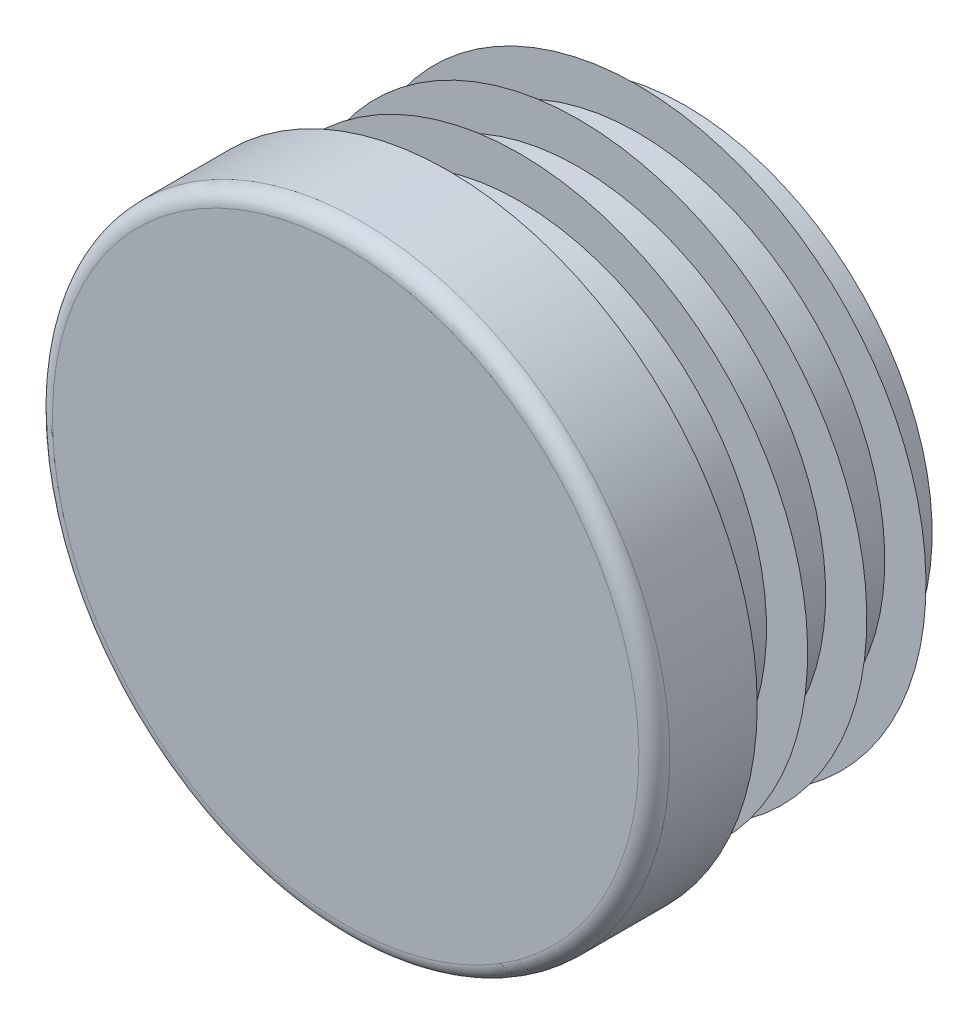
ISO-10303-21;
HEADER;
FILE_DESCRIPTION(('STEP AP214'),'2;1');
FILE_NAME('part.step','',(''),(''),'','','');
FILE_SCHEMA(('AUTOMOTIVE_DESIGN { 1 0 10303 214 1 1 1 1 }'));
ENDSEC;
DATA;
#1=APPLICATION_CONTEXT('core data for automotive mechanical design processes');
#2=APPLICATION_PROTOCOL_DEFINITION('international standard','automotive_design',2000,#1);
#3=PRODUCT_CONTEXT('',#1,'mechanical');
#4=PRODUCT('Part','Part','',(#3));
#5=PRODUCT_RELATED_PRODUCT_CATEGORY('part','',(#4));
#6=PRODUCT_DEFINITION_FORMATION('','',#4);
#7=PRODUCT_DEFINITION_CONTEXT('part definition',#1,'design');
#8=PRODUCT_DEFINITION('design','',#6,#7);
#9=PRODUCT_DEFINITION_SHAPE('','',#8);
#10=(LENGTH_UNIT() NAMED_UNIT(*) SI_UNIT(.MILLI.,.METRE.));
#11=(NAMED_UNIT(*) PLANE_ANGLE_UNIT() SI_UNIT($,.RADIAN.));
#12=(NAMED_UNIT(*) SI_UNIT($,.STERADIAN.) SOLID_ANGLE_UNIT());
#13=UNCERTAINTY_MEASURE_WITH_UNIT(LENGTH_MEASURE(1.E-05),#10,'distance_accuracy_value','');
#14=(GEOMETRIC_REPRESENTATION_CONTEXT(3) GLOBAL_UNCERTAINTY_ASSIGNED_CONTEXT((#13)) GLOBAL_UNIT_ASSIGNED_CONTEXT((#10,
#11,#12)) REPRESENTATION_CONTEXT('',''));
#15=CARTESIAN_POINT('',(0.,0.,0.));
#16=DIRECTION('',(0.,0.,1.));
#17=DIRECTION('',(1.,0.,0.));
#18=AXIS2_PLACEMENT_3D('',#15,#16,#17);
#19=CARTESIAN_POINT('',(0.,0.,5.));
#20=DIRECTION('',(0.,0.,-1.));
#21=DIRECTION('',(0.,1.,0.));
#22=AXIS2_PLACEMENT_3D('',#19,#20,#21);
#23=PLANE('',#22);
#24=CARTESIAN_POINT('',(0.,0.,5.));
#25=DIRECTION('',(0.,0.,-1.));
#26=DIRECTION('',(0.,1.,0.));
#27=AXIS2_PLACEMENT_3D('',#24,#25,#26);
#28=CIRCLE('',#27,14.25);
#29=CARTESIAN_POINT('',(0.,14.25,5.));
#30=VERTEX_POINT('',#29);
#31=EDGE_CURVE('E8',#30,#30,#28,.T.);
#32=ORIENTED_EDGE('',*,*,#31,.F.);
#33=EDGE_LOOP('',(#32));
#34=FACE_BOUND('',#33,.T.);
#35=ADVANCED_FACE('F12',(#34),#23,.F.);
#36=CARTESIAN_POINT('',(0.,0.,4.25));
#37=DIRECTION('',(0.,0.,-1.));
#38=DIRECTION('',(0.,1.,0.));
#39=AXIS2_PLACEMENT_3D('',#36,#37,#38);
#40=TOROIDAL_SURFACE('',#39,14.25,0.75);
#41=ORIENTED_EDGE('',*,*,#31,.T.);
#42=EDGE_LOOP('',(#41));
#43=FACE_BOUND('',#42,.T.);
#44=CARTESIAN_POINT('',(0.,0.,4.25));
#45=DIRECTION('',(0.,0.,-1.));
#46=DIRECTION('',(0.,1.,0.));
#47=AXIS2_PLACEMENT_3D('',#44,#45,#46);
#48=CIRCLE('',#47,15.);
#49=CARTESIAN_POINT('',(0.,15.,4.25));
#50=VERTEX_POINT('',#49);
#51=EDGE_CURVE('E18',#50,#50,#48,.T.);
#52=ORIENTED_EDGE('',*,*,#51,.F.);
#53=EDGE_LOOP('',(#52));
#54=FACE_BOUND('',#53,.T.);
#55=ADVANCED_FACE('F159',(#43,#54),#40,.T.);
#56=CARTESIAN_POINT('',(0.,0.,-11.5));
#57=DIRECTION('',(0.,0.,-1.));
#58=DIRECTION('',(0.,1.,0.));
#59=AXIS2_PLACEMENT_3D('',#56,#57,#58);
#60=CYLINDRICAL_SURFACE('',#59,15.);
#61=CARTESIAN_POINT('',(0.,0.,0.));
#62=DIRECTION('',(0.,0.,-1.));
#63=DIRECTION('',(0.,1.,0.));
#64=AXIS2_PLACEMENT_3D('',#61,#62,#63);
#65=CIRCLE('',#64,15.);
#66=CARTESIAN_POINT('',(0.,15.,0.));
#67=VERTEX_POINT('',#66);
#68=EDGE_CURVE('E22',#67,#67,#65,.T.);
#69=ORIENTED_EDGE('',*,*,#68,.F.);
#70=EDGE_LOOP('',(#69));
#71=FACE_BOUND('',#70,.T.);
#72=ORIENTED_EDGE('',*,*,#51,.T.);
#73=EDGE_LOOP('',(#72));
#74=FACE_BOUND('',#73,.T.);
#75=ADVANCED_FACE('F154',(#71,#74),#60,.T.);
#76=CARTESIAN_POINT('',(15.,0.,0.));
#77=DIRECTION('',(0.,0.,1.));
#78=DIRECTION('',(0.,-1.,0.));
#79=AXIS2_PLACEMENT_3D('',#76,#77,#78);
#80=PLANE('',#79);
#81=CARTESIAN_POINT('',(0.,0.,0.));
#82=DIRECTION('',(0.,0.,-1.));
#83=DIRECTION('',(0.,1.,0.));
#84=AXIS2_PLACEMENT_3D('',#81,#82,#83);
#85=CIRCLE('',#84,12.);
#86=CARTESIAN_POINT('',(0.,12.,0.));
#87=VERTEX_POINT('',#86);
#88=EDGE_CURVE('E26',#87,#87,#85,.T.);
#89=ORIENTED_EDGE('',*,*,#88,.F.);
#90=EDGE_LOOP('',(#89));
#91=FACE_BOUND('',#90,.T.);
#92=ORIENTED_EDGE('',*,*,#68,.T.);
#93=EDGE_LOOP('',(#92));
#94=FACE_BOUND('',#93,.T.);
#95=ADVANCED_FACE('F148',(#91,#94),#80,.F.);
#96=CARTESIAN_POINT('',(0.,0.,-11.5));
#97=DIRECTION('',(0.,0.,-1.));
#98=DIRECTION('',(0.,1.,0.));
#99=AXIS2_PLACEMENT_3D('',#96,#97,#98);
#100=CYLINDRICAL_SURFACE('',#99,12.);
#101=CARTESIAN_POINT('',(0.,0.,-0.575));
#102=DIRECTION('',(0.,0.,-1.));
#103=DIRECTION('',(0.,1.,0.));
#104=AXIS2_PLACEMENT_3D('',#101,#102,#103);
#105=CIRCLE('',#104,12.);
#106=CARTESIAN_POINT('',(0.,12.,-0.575));
#107=VERTEX_POINT('',#106);
#108=EDGE_CURVE('E31',#107,#107,#105,.T.);
#109=ORIENTED_EDGE('',*,*,#108,.F.);
#110=EDGE_LOOP('',(#109));
#111=FACE_BOUND('',#110,.T.);
#112=ORIENTED_EDGE('',*,*,#88,.T.);
#113=EDGE_LOOP('',(#112));
#114=FACE_BOUND('',#113,.T.);
#115=ADVANCED_FACE('F142',(#111,#114),#100,.T.);
#116=CARTESIAN_POINT('',(12.,0.,-0.575));
#117=DIRECTION('',(0.,0.,-1.));
#118=DIRECTION('',(0.,1.,0.));
#119=AXIS2_PLACEMENT_3D('',#116,#117,#118);
#120=PLANE('',#119);
#121=CARTESIAN_POINT('',(0.,0.,-0.575));
#122=DIRECTION('',(0.,0.,-1.));
#123=DIRECTION('',(0.,1.,0.));
#124=AXIS2_PLACEMENT_3D('',#121,#122,#123);
#125=CIRCLE('',#124,14.);
#126=CARTESIAN_POINT('',(0.,14.,-0.575));
#127=VERTEX_POINT('',#126);
#128=EDGE_CURVE('E34',#127,#127,#125,.T.);
#129=ORIENTED_EDGE('',*,*,#128,.F.);
#130=EDGE_LOOP('',(#129));
#131=FACE_BOUND('',#130,.T.);
#132=ORIENTED_EDGE('',*,*,#108,.T.);
#133=EDGE_LOOP('',(#132));
#134=FACE_BOUND('',#133,.T.);
#135=ADVANCED_FACE('F136',(#131,#134),#120,.F.);
#136=CARTESIAN_POINT('',(0.,0.,-0.575));
#137=DIRECTION('',(0.,0.,1.));
#138=DIRECTION('',(0.,-1.,0.));
#139=AXIS2_PLACEMENT_3D('',#136,#137,#138);
#140=CONICAL_SURFACE('',#139,14.,0.959931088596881);
#141=CARTESIAN_POINT('',(0.,0.,-1.97541507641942));
#142=DIRECTION('',(0.,0.,-1.));
#143=DIRECTION('',(0.,1.,0.));
#144=AXIS2_PLACEMENT_3D('',#141,#142,#143);
#145=CIRCLE('',#144,12.);
#146=CARTESIAN_POINT('',(0.,12.,-1.97541507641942));
#147=VERTEX_POINT('',#146);
#148=EDGE_CURVE('E37',#147,#147,#145,.T.);
#149=ORIENTED_EDGE('',*,*,#148,.F.);
#150=EDGE_LOOP('',(#149));
#151=FACE_BOUND('',#150,.T.);
#152=ORIENTED_EDGE('',*,*,#128,.T.);
#153=EDGE_LOOP('',(#152));
#154=FACE_BOUND('',#153,.T.);
#155=ADVANCED_FACE('F130',(#151,#154),#140,.T.);
#156=CARTESIAN_POINT('',(0.,0.,-11.5));
#157=DIRECTION('',(0.,0.,-1.));
#158=DIRECTION('',(0.,1.,0.));
#159=AXIS2_PLACEMENT_3D('',#156,#157,#158);
#160=CYLINDRICAL_SURFACE('',#159,12.);
#161=CARTESIAN_POINT('',(0.,0.,-3.45));
#162=DIRECTION('',(0.,0.,-1.));
#163=DIRECTION('',(0.,1.,0.));
#164=AXIS2_PLACEMENT_3D('',#161,#162,#163);
#165=CIRCLE('',#164,12.);
#166=CARTESIAN_POINT('',(0.,12.,-3.45));
#167=VERTEX_POINT('',#166);
#168=EDGE_CURVE('E40',#167,#167,#165,.T.);
#169=ORIENTED_EDGE('',*,*,#168,.F.);
#170=EDGE_LOOP('',(#169));
#171=FACE_BOUND('',#170,.T.);
#172=ORIENTED_EDGE('',*,*,#148,.T.);
#173=EDGE_LOOP('',(#172));
#174=FACE_BOUND('',#173,.T.);
#175=ADVANCED_FACE('F124',(#171,#174),#160,.T.);
#176=CARTESIAN_POINT('',(12.,0.,-3.45));
#177=DIRECTION('',(0.,0.,-1.));
#178=DIRECTION('',(0.,1.,0.));
#179=AXIS2_PLACEMENT_3D('',#176,#177,#178);
#180=PLANE('',#179);
#181=CARTESIAN_POINT('',(0.,0.,-3.45));
#182=DIRECTION('',(0.,0.,-1.));
#183=DIRECTION('',(0.,1.,0.));
#184=AXIS2_PLACEMENT_3D('',#181,#182,#183);
#185=CIRCLE('',#184,14.);
#186=CARTESIAN_POINT('',(0.,14.,-3.45));
#187=VERTEX_POINT('',#186);
#188=EDGE_CURVE('E43',#187,#187,#185,.T.);
#189=ORIENTED_EDGE('',*,*,#188,.F.);
#190=EDGE_LOOP('',(#189));
#191=FACE_BOUND('',#190,.T.);
#192=ORIENTED_EDGE('',*,*,#168,.T.);
#193=EDGE_LOOP('',(#192));
#194=FACE_BOUND('',#193,.T.);
#195=ADVANCED_FACE('F118',(#191,#194),#180,.F.);
#196=CARTESIAN_POINT('',(0.,0.,-3.45));
#197=DIRECTION('',(0.,0.,1.));
#198=DIRECTION('',(0.,-1.,0.));
#199=AXIS2_PLACEMENT_3D('',#196,#197,#198);
#200=CONICAL_SURFACE('',#199,14.,0.959931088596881);
#201=CARTESIAN_POINT('',(0.,0.,-4.85041507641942));
#202=DIRECTION('',(0.,0.,-1.));
#203=DIRECTION('',(0.,1.,0.));
#204=AXIS2_PLACEMENT_3D('',#201,#202,#203);
#205=CIRCLE('',#204,12.);
#206=CARTESIAN_POINT('',(0.,12.,-4.85041507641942));
#207=VERTEX_POINT('',#206);
#208=EDGE_CURVE('E46',#207,#207,#205,.T.);
#209=ORIENTED_EDGE('',*,*,#208,.F.);
#210=EDGE_LOOP('',(#209));
#211=FACE_BOUND('',#210,.T.);
#212=ORIENTED_EDGE('',*,*,#188,.T.);
#213=EDGE_LOOP('',(#212));
#214=FACE_BOUND('',#213,.T.);
#215=ADVANCED_FACE('F112',(#211,#214),#200,.T.);
#216=CARTESIAN_POINT('',(0.,0.,-11.5));
#217=DIRECTION('',(0.,0.,-1.));
#218=DIRECTION('',(0.,1.,0.));
#219=AXIS2_PLACEMENT_3D('',#216,#217,#218);
#220=CYLINDRICAL_SURFACE('',#219,12.);
#221=CARTESIAN_POINT('',(0.,0.,-6.325));
#222=DIRECTION('',(0.,0.,-1.));
#223=DIRECTION('',(0.,1.,0.));
#224=AXIS2_PLACEMENT_3D('',#221,#222,#223);
#225=CIRCLE('',#224,12.);
#226=CARTESIAN_POINT('',(0.,12.,-6.325));
#227=VERTEX_POINT('',#226);
#228=EDGE_CURVE('E49',#227,#227,#225,.T.);
#229=ORIENTED_EDGE('',*,*,#228,.F.);
#230=EDGE_LOOP('',(#229));
#231=FACE_BOUND('',#230,.T.);
#232=ORIENTED_EDGE('',*,*,#208,.T.);
#233=EDGE_LOOP('',(#232));
#234=FACE_BOUND('',#233,.T.);
#235=ADVANCED_FACE('F106',(#231,#234),#220,.T.);
#236=CARTESIAN_POINT('',(12.,0.,-6.325));
#237=DIRECTION('',(0.,0.,-1.));
#238=DIRECTION('',(0.,1.,0.));
#239=AXIS2_PLACEMENT_3D('',#236,#237,#238);
#240=PLANE('',#239);
#241=CARTESIAN_POINT('',(0.,0.,-6.325));
#242=DIRECTION('',(0.,0.,-1.));
#243=DIRECTION('',(0.,1.,0.));
#244=AXIS2_PLACEMENT_3D('',#241,#242,#243);
#245=CIRCLE('',#244,14.);
#246=CARTESIAN_POINT('',(0.,14.,-6.325));
#247=VERTEX_POINT('',#246);
#248=EDGE_CURVE('E52',#247,#247,#245,.T.);
#249=ORIENTED_EDGE('',*,*,#248,.F.);
#250=EDGE_LOOP('',(#249));
#251=FACE_BOUND('',#250,.T.);
#252=ORIENTED_EDGE('',*,*,#228,.T.);
#253=EDGE_LOOP('',(#252));
#254=FACE_BOUND('',#253,.T.);
#255=ADVANCED_FACE('F100',(#251,#254),#240,.F.);
#256=CARTESIAN_POINT('',(0.,0.,-6.325));
#257=DIRECTION('',(0.,0.,1.));
#258=DIRECTION('',(0.,-1.,0.));
#259=AXIS2_PLACEMENT_3D('',#256,#257,#258);
#260=CONICAL_SURFACE('',#259,14.,0.959931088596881);
#261=CARTESIAN_POINT('',(0.,0.,-7.72541507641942));
#262=DIRECTION('',(0.,0.,-1.));
#263=DIRECTION('',(0.,1.,0.));
#264=AXIS2_PLACEMENT_3D('',#261,#262,#263);
#265=CIRCLE('',#264,12.);
#266=CARTESIAN_POINT('',(0.,12.,-7.72541507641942));
#267=VERTEX_POINT('',#266);
#268=EDGE_CURVE('E55',#267,#267,#265,.T.);
#269=ORIENTED_EDGE('',*,*,#268,.F.);
#270=EDGE_LOOP('',(#269));
#271=FACE_BOUND('',#270,.T.);
#272=ORIENTED_EDGE('',*,*,#248,.T.);
#273=EDGE_LOOP('',(#272));
#274=FACE_BOUND('',#273,.T.);
#275=ADVANCED_FACE('F94',(#271,#274),#260,.T.);
#276=CARTESIAN_POINT('',(0.,0.,-11.5));
#277=DIRECTION('',(0.,0.,-1.));
#278=DIRECTION('',(0.,1.,0.));
#279=AXIS2_PLACEMENT_3D('',#276,#277,#278);
#280=CYLINDRICAL_SURFACE('',#279,12.);
#281=CARTESIAN_POINT('',(0.,0.,-9.2));
#282=DIRECTION('',(0.,0.,-1.));
#283=DIRECTION('',(0.,1.,0.));
#284=AXIS2_PLACEMENT_3D('',#281,#282,#283);
#285=CIRCLE('',#284,12.);
#286=CARTESIAN_POINT('',(0.,12.,-9.2));
#287=VERTEX_POINT('',#286);
#288=EDGE_CURVE('E58',#287,#287,#285,.T.);
#289=ORIENTED_EDGE('',*,*,#288,.F.);
#290=EDGE_LOOP('',(#289));
#291=FACE_BOUND('',#290,.T.);
#292=ORIENTED_EDGE('',*,*,#268,.T.);
#293=EDGE_LOOP('',(#292));
#294=FACE_BOUND('',#293,.T.);
#295=ADVANCED_FACE('F88',(#291,#294),#280,.T.);
#296=CARTESIAN_POINT('',(12.,0.,-9.2));
#297=DIRECTION('',(0.,0.,-1.));
#298=DIRECTION('',(0.,1.,0.));
#299=AXIS2_PLACEMENT_3D('',#296,#297,#298);
#300=PLANE('',#299);
#301=CARTESIAN_POINT('',(0.,0.,-9.2));
#302=DIRECTION('',(0.,0.,-1.));
#303=DIRECTION('',(0.,1.,0.));
#304=AXIS2_PLACEMENT_3D('',#301,#302,#303);
#305=CIRCLE('',#304,14.);
#306=CARTESIAN_POINT('',(0.,14.,-9.2));
#307=VERTEX_POINT('',#306);
#308=EDGE_CURVE('E61',#307,#307,#305,.T.);
#309=ORIENTED_EDGE('',*,*,#308,.F.);
#310=EDGE_LOOP('',(#309));
#311=FACE_BOUND('',#310,.T.);
#312=ORIENTED_EDGE('',*,*,#288,.T.);
#313=EDGE_LOOP('',(#312));
#314=FACE_BOUND('',#313,.T.);
#315=ADVANCED_FACE('F82',(#311,#314),#300,.F.);
#316=CARTESIAN_POINT('',(0.,0.,-9.2));
#317=DIRECTION('',(0.,0.,1.));
#318=DIRECTION('',(0.,-1.,0.));
#319=AXIS2_PLACEMENT_3D('',#316,#317,#318);
#320=CONICAL_SURFACE('',#319,14.,0.959931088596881);
#321=CARTESIAN_POINT('',(0.,0.,-10.6004150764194));
#322=DIRECTION('',(0.,0.,-1.));
#323=DIRECTION('',(0.,1.,0.));
#324=AXIS2_PLACEMENT_3D('',#321,#322,#323);
#325=CIRCLE('',#324,12.);
#326=CARTESIAN_POINT('',(0.,12.,-10.6004150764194));
#327=VERTEX_POINT('',#326);
#328=EDGE_CURVE('E64',#327,#327,#325,.T.);
#329=ORIENTED_EDGE('',*,*,#328,.F.);
#330=EDGE_LOOP('',(#329));
#331=FACE_BOUND('',#330,.T.);
#332=ORIENTED_EDGE('',*,*,#308,.T.);
#333=EDGE_LOOP('',(#332));
#334=FACE_BOUND('',#333,.T.);
#335=ADVANCED_FACE('F76',(#331,#334),#320,.T.);
#336=CARTESIAN_POINT('',(0.,0.,-11.5));
#337=DIRECTION('',(0.,0.,-1.));
#338=DIRECTION('',(0.,1.,0.));
#339=AXIS2_PLACEMENT_3D('',#336,#337,#338);
#340=CYLINDRICAL_SURFACE('',#339,12.);
#341=CARTESIAN_POINT('',(0.,0.,-11.5));
#342=DIRECTION('',(0.,0.,-1.));
#343=DIRECTION('',(0.,1.,0.));
#344=AXIS2_PLACEMENT_3D('',#341,#342,#343);
#345=CIRCLE('',#344,12.);
#346=CARTESIAN_POINT('',(0.,12.,-11.5));
#347=VERTEX_POINT('',#346);
#348=EDGE_CURVE('E67',#347,#347,#345,.T.);
#349=ORIENTED_EDGE('',*,*,#348,.F.);
#350=EDGE_LOOP('',(#349));
#351=FACE_BOUND('',#350,.T.);
#352=ORIENTED_EDGE('',*,*,#328,.T.);
#353=EDGE_LOOP('',(#352));
#354=FACE_BOUND('',#353,.T.);
#355=ADVANCED_FACE('F73',(#351,#354),#340,.T.);
#356=CARTESIAN_POINT('',(12.,0.,-11.5));
#357=DIRECTION('',(0.,0.,1.));
#358=DIRECTION('',(0.,-1.,0.));
#359=AXIS2_PLACEMENT_3D('',#356,#357,#358);
#360=PLANE('',#359);
#361=ORIENTED_EDGE('',*,*,#348,.T.);
#362=EDGE_LOOP('',(#361));
#363=FACE_BOUND('',#362,.T.);
#364=ADVANCED_FACE('F71',(#363),#360,.F.);
#365=CLOSED_SHELL('',(#35,#55,#75,#95,#115,#135,#155,#175,#195,#215,#235,#255,#275,#295,#315,
#335,#355,#364));
#366=MANIFOLD_SOLID_BREP('B1',#365);
#367=ADVANCED_BREP_SHAPE_REPRESENTATION('',(#18,#366),#14);
#368=SHAPE_DEFINITION_REPRESENTATION(#9,#367);
ENDSEC;
END-ISO-10303-21;
